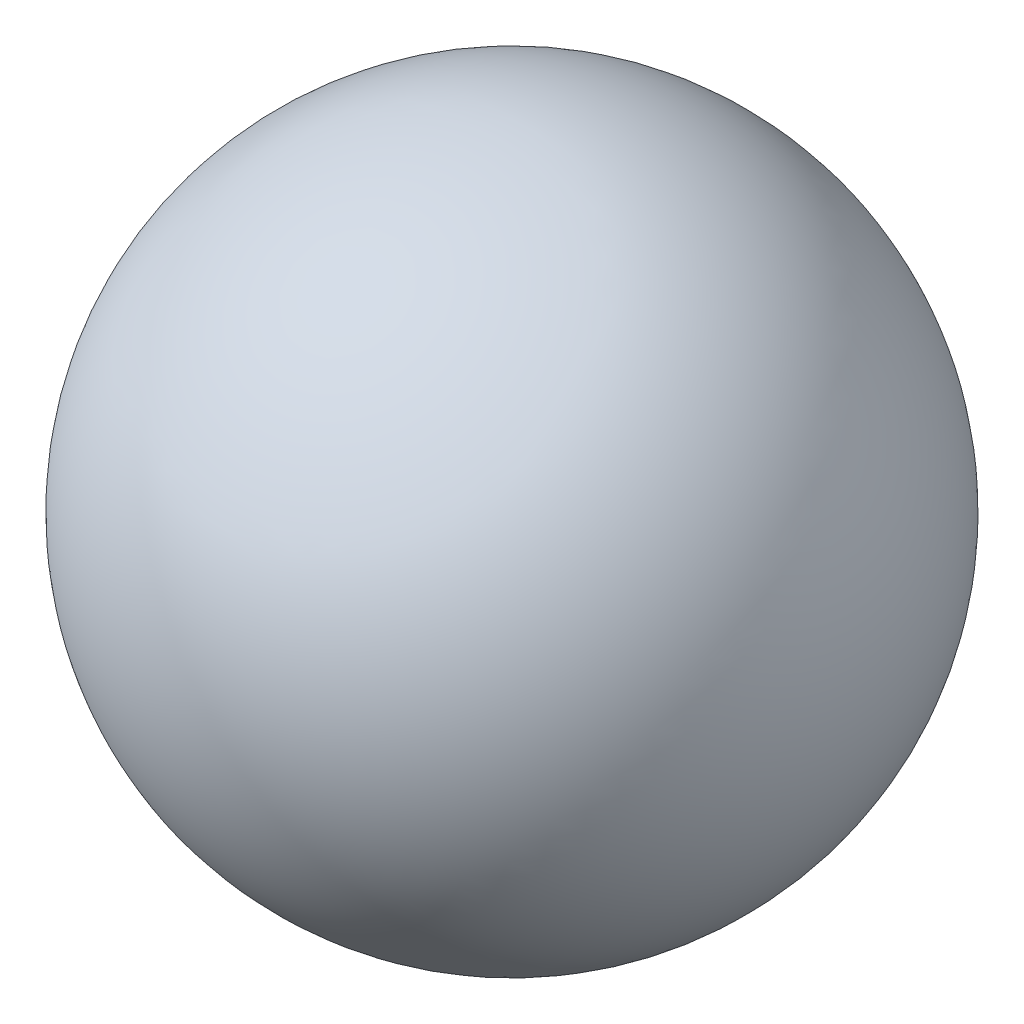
from build123d import *


with BuildPart() as part:
    # Sketch1 → Revolve1 (revolve)
    with BuildSketch(Plane(origin=(0, 0, 0), x_dir=(1, 0, 0), z_dir=(0, 1, 0))):
        with BuildLine():
            Line((0, -2.38125), (0, 2.38125))
            ThreePointArc((0, 2.38125), (2.38125, 0), (0, -2.38125))
        make_face()
    revolve(axis=Axis((0, 0, 2.38125), (0, 0, 1)))


solid = part.part
